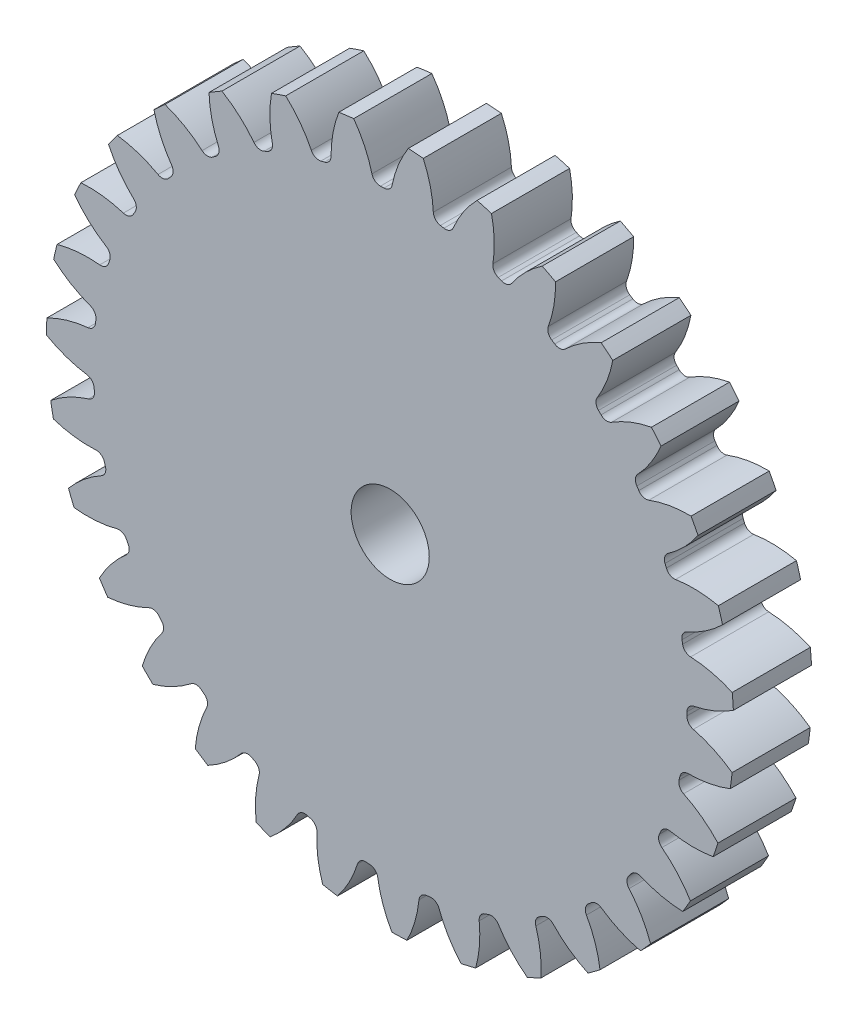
from build123d import *

# Parameters (mm, degrees)
SKETCH3_R         = 558.8
GEARBODY_DEPTH    = 127
TOOTHCUT_DEPTH    = 801.402323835
CIRPATTERN1_COUNT = 31
BOREDIA_R         = 63.5
BORE_DEPTH        = 12700


with BuildPart() as part:
    # Sketch3 → gearBody (new body)
    with BuildSketch(Plane.XY):
        Circle(SKETCH3_R)
    extrude(amount=GEARBODY_DEPTH)

    # Sketch2 → toothCut (cut, through all)
    with BuildSketch(Plane.XY):
        with BuildLine():
            ThreePointArc((482.3833937, -14.457575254), (482.462691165, -11.511369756), (482.523994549, -8.564734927))
            ThreePointArc((482.523994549, -8.564734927), (485.701206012, -0.003730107), (493.532571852, 4.69256474))
            ThreePointArc((493.532571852, 4.69256474), (527.443390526, 15.073333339), (558.8, 31.640379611))
            ThreePointArc((558.8, 31.640379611), (559.535810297, -13.350304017), (556.655138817, -58.254699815))
            ThreePointArc((556.655138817, -58.254699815), (526.12432706, -40.211044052), (492.747176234, -28.224811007))
            ThreePointArc((492.747176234, -28.224811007), (485.148697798, -23.160366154), (482.3833937, -14.457575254))
        make_face()
    toothcut = extrude(amount=TOOTHCUT_DEPTH, mode=Mode.SUBTRACT)

    # CirPattern1: toothCut ×31 about axis
    cirpattern1_axis = Axis((0, 0, 0), (0, 0, 1))
    for i in range(1, CIRPATTERN1_COUNT):
        add(toothcut.rotate(cirpattern1_axis, i * 360 / CIRPATTERN1_COUNT), mode=Mode.SUBTRACT)

    # boreDia → bore (cut, symmetric)
    with BuildSketch(Plane.XY):
        Circle(BOREDIA_R)
    extrude(amount=BORE_DEPTH, both=True, mode=Mode.SUBTRACT)


solid = part.part
